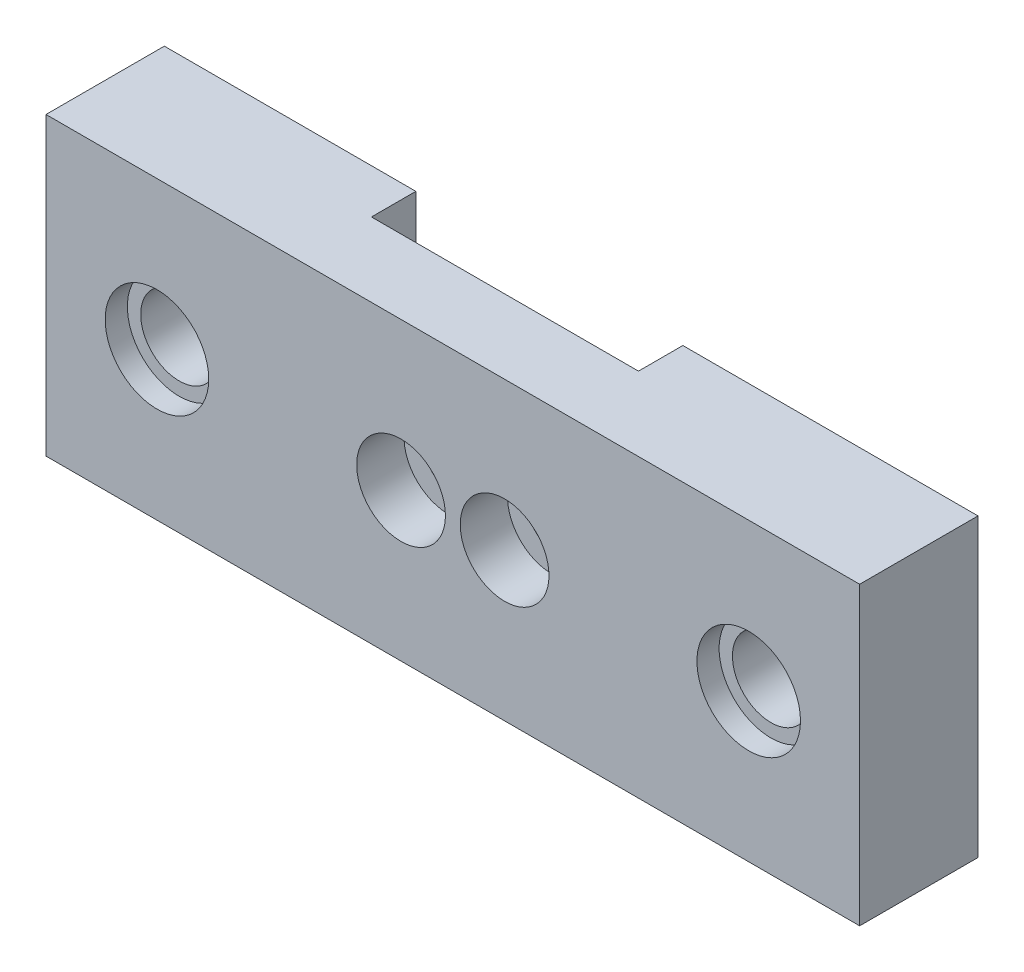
from build123d import *

# Parameters (mm, degrees)
ESQUISSE1_W             = 55
ESQUISSE1_H             = 20
ESQUISSE1_R             = 2.6
ESQUISSE1_R_2           = 1.55
EXTRUSION1_DEPTH        = 8
ESQUISSE2_R             = 3.5
ENL_V_MAT_EXTRU_1_DEPTH = 1.5
ESQUISSE3_R             = 3
ENL_V_MAT_EXTRU_2_DEPTH = 3.2
ESQUISSE4_R             = 1.55
ENL_V_MAT_EXTRU_3_DEPTH = 3


with BuildPart() as part:
    # Esquisse1 → Extrusion1 (new body)
    with BuildSketch(Plane.XY):
        Rectangle(ESQUISSE1_W, ESQUISSE1_H)
        with Locations((-20, 0)):
            Circle(ESQUISSE1_R, mode=Mode.SUBTRACT)
        with Locations((20, 0)):
            Circle(ESQUISSE1_R, mode=Mode.SUBTRACT)
        with Locations((-3.5, 0)):
            Circle(ESQUISSE1_R_2, mode=Mode.SUBTRACT)
        with Locations((3.5, 0)):
            Circle(ESQUISSE1_R_2, mode=Mode.SUBTRACT)
    extrude(amount=EXTRUSION1_DEPTH)

    # Esquisse2 → Enl_v. mat.-Extru.1 (cut)
    with BuildSketch(Plane.XY.offset(8)):
        with Locations((-20, 0)):
            Circle(ESQUISSE2_R)
        with Locations((20, 0)):
            Circle(ESQUISSE2_R)
    extrude(amount=-ENL_V_MAT_EXTRU_1_DEPTH, mode=Mode.SUBTRACT)

    # Esquisse3 → Enl_v. mat.-Extru.2 (cut)
    with BuildSketch(Plane.XY.offset(8)):
        with Locations((-3.5, 0)):
            Circle(ESQUISSE3_R)
        with Locations((3.5, 0)):
            Circle(ESQUISSE3_R)
    extrude(amount=-ENL_V_MAT_EXTRU_2_DEPTH, mode=Mode.SUBTRACT)

    # Esquisse4 → Enl_v. mat.-Extru.3 (cut)
    with BuildSketch(Plane(origin=(0, 0, 0), x_dir=(-1, 0, 0), z_dir=(0, 0, -1))):
        with BuildLine():
            Line((-7.55, 10), (-7.55, -10))
            Line((-7.55, -10), (7.55, -10))
            Line((7.55, -10), (7.55, 3.000416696))
            ThreePointArc((7.55, 3.000416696), (9.638924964, 3.896431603), (10.5, 6))
            Line((10.5, 6), (10.5, 10))
            Line((10.5, 10), (-7.55, 10))
        make_face()
        with Locations((-3.5, 0)):
            Circle(ESQUISSE4_R, mode=Mode.SUBTRACT)
        with Locations((3.5, 0)):
            Circle(ESQUISSE4_R, mode=Mode.SUBTRACT)
    extrude(amount=-ENL_V_MAT_EXTRU_3_DEPTH, mode=Mode.SUBTRACT)


solid = part.part
